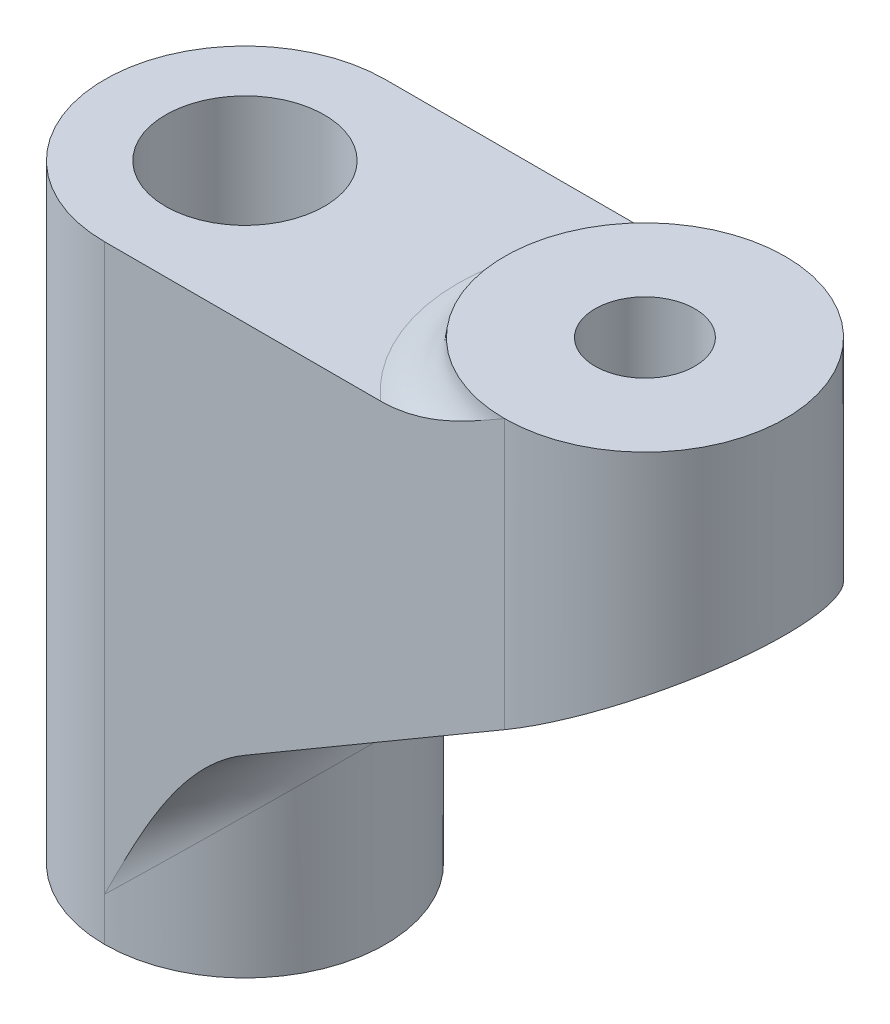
ISO-10303-21;
HEADER;
FILE_DESCRIPTION(('STEP AP214'),'2;1');
FILE_NAME('part.step','',(''),(''),'','','');
FILE_SCHEMA(('AUTOMOTIVE_DESIGN { 1 0 10303 214 1 1 1 1 }'));
ENDSEC;
DATA;
#1=APPLICATION_CONTEXT('core data for automotive mechanical design processes');
#2=APPLICATION_PROTOCOL_DEFINITION('international standard','automotive_design',2000,#1);
#3=PRODUCT_CONTEXT('',#1,'mechanical');
#4=PRODUCT('Part','Part','',(#3));
#5=PRODUCT_RELATED_PRODUCT_CATEGORY('part','',(#4));
#6=PRODUCT_DEFINITION_FORMATION('','',#4);
#7=PRODUCT_DEFINITION_CONTEXT('part definition',#1,'design');
#8=PRODUCT_DEFINITION('design','',#6,#7);
#9=PRODUCT_DEFINITION_SHAPE('','',#8);
#10=(LENGTH_UNIT() NAMED_UNIT(*) SI_UNIT(.MILLI.,.METRE.));
#11=(NAMED_UNIT(*) PLANE_ANGLE_UNIT() SI_UNIT($,.RADIAN.));
#12=(NAMED_UNIT(*) SI_UNIT($,.STERADIAN.) SOLID_ANGLE_UNIT());
#13=UNCERTAINTY_MEASURE_WITH_UNIT(LENGTH_MEASURE(1.E-05),#10,'distance_accuracy_value','');
#14=(GEOMETRIC_REPRESENTATION_CONTEXT(3) GLOBAL_UNCERTAINTY_ASSIGNED_CONTEXT((#13)) GLOBAL_UNIT_ASSIGNED_CONTEXT((#10,
#11,#12)) REPRESENTATION_CONTEXT('',''));
#15=CARTESIAN_POINT('',(0.,0.,0.));
#16=DIRECTION('',(0.,0.,1.));
#17=DIRECTION('',(1.,0.,0.));
#18=AXIS2_PLACEMENT_3D('',#15,#16,#17);
#19=CARTESIAN_POINT('',(0.,12.7,0.));
#20=DIRECTION('',(0.,1.,0.));
#21=DIRECTION('',(-1.,0.,0.));
#22=AXIS2_PLACEMENT_3D('',#19,#20,#21);
#23=CYLINDRICAL_SURFACE('',#22,3.81);
#24=DIRECTION('',(0.,-1.,0.));
#25=VECTOR('',#24,1.);
#26=CARTESIAN_POINT('',(0.,0.,-3.81));
#27=LINE('',#26,#25);
#28=CARTESIAN_POINT('',(0.,0.,-3.81));
#29=VERTEX_POINT('',#28);
#30=CARTESIAN_POINT('',(0.,1.17739829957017,-3.81));
#31=VERTEX_POINT('',#30);
#32=EDGE_CURVE('E166',#29,#31,#27,.F.);
#33=ORIENTED_EDGE('',*,*,#32,.T.);
#34=CARTESIAN_POINT('',(0.,1.17739829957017,0.));
#35=DIRECTION('',(0.698226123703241,-0.715877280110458,0.));
#36=DIRECTION('',(0.715877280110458,0.698226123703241,0.));
#37=AXIS2_PLACEMENT_3D('',#34,#35,#36);
#38=ELLIPSE('',#37,5.32214124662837,3.81);
#39=CARTESIAN_POINT('',(0.,1.17739829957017,3.81));
#40=VERTEX_POINT('',#39);
#41=EDGE_CURVE('E189',#31,#40,#38,.T.);
#42=ORIENTED_EDGE('',*,*,#41,.T.);
#43=DIRECTION('',(0.,1.,0.));
#44=VECTOR('',#43,1.);
#45=CARTESIAN_POINT('',(0.,0.,3.81));
#46=LINE('',#45,#44);
#47=CARTESIAN_POINT('',(0.,0.,3.81));
#48=VERTEX_POINT('',#47);
#49=EDGE_CURVE('E170',#40,#48,#46,.F.);
#50=ORIENTED_EDGE('',*,*,#49,.T.);
#51=CARTESIAN_POINT('',(0.,0.,0.));
#52=DIRECTION('',(0.,1.,0.));
#53=DIRECTION('',(0.,0.,1.));
#54=AXIS2_PLACEMENT_3D('',#51,#52,#53);
#55=CIRCLE('',#54,3.81);
#56=EDGE_CURVE('E182',#29,#48,#55,.F.);
#57=ORIENTED_EDGE('',*,*,#56,.F.);
#58=EDGE_LOOP('',(#33,#42,#50,#57));
#59=FACE_BOUND('',#58,.T.);
#60=ADVANCED_FACE('F54',(#59),#23,.T.);
#61=CARTESIAN_POINT('',(0.,0.,0.));
#62=DIRECTION('',(0.,-1.,0.));
#63=DIRECTION('',(1.,0.,0.));
#64=AXIS2_PLACEMENT_3D('',#61,#62,#63);
#65=CYLINDRICAL_SURFACE('',#64,3.81);
#66=ORIENTED_EDGE('',*,*,#32,.F.);
#67=CARTESIAN_POINT('',(0.,0.,0.));
#68=DIRECTION('',(0.,1.,0.));
#69=DIRECTION('',(0.,0.,1.));
#70=AXIS2_PLACEMENT_3D('',#67,#68,#69);
#71=CIRCLE('',#70,3.81);
#72=EDGE_CURVE('E174',#48,#29,#71,.F.);
#73=ORIENTED_EDGE('',*,*,#72,.F.);
#74=ORIENTED_EDGE('',*,*,#49,.F.);
#75=CARTESIAN_POINT('',(0.,16.51,3.81));
#76=VERTEX_POINT('',#75);
#77=EDGE_CURVE('E171',#76,#40,#46,.F.);
#78=ORIENTED_EDGE('',*,*,#77,.F.);
#79=CARTESIAN_POINT('',(0.,16.51,0.));
#80=DIRECTION('',(0.,-1.,0.));
#81=DIRECTION('',(1.,0.,0.));
#82=AXIS2_PLACEMENT_3D('',#79,#80,#81);
#83=CIRCLE('',#82,3.81);
#84=CARTESIAN_POINT('',(0.,16.51,-3.81));
#85=VERTEX_POINT('',#84);
#86=EDGE_CURVE('E178',#85,#76,#83,.F.);
#87=ORIENTED_EDGE('',*,*,#86,.F.);
#88=EDGE_CURVE('E149',#31,#85,#27,.F.);
#89=ORIENTED_EDGE('',*,*,#88,.F.);
#90=EDGE_LOOP('',(#66,#73,#74,#78,#87,#89));
#91=FACE_BOUND('',#90,.T.);
#92=ADVANCED_FACE('F251',(#91),#65,.T.);
#93=CARTESIAN_POINT('',(10.85088,10.4703651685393,0.));
#94=DIRECTION('',(0.,1.,0.));
#95=DIRECTION('',(-1.,0.,0.));
#96=AXIS2_PLACEMENT_3D('',#93,#94,#95);
#97=CYLINDRICAL_SURFACE('',#96,3.81);
#98=CARTESIAN_POINT('',(10.85088,17.78,0.));
#99=DIRECTION('',(0.,1.,0.));
#100=DIRECTION('',(-1.,0.,0.));
#101=AXIS2_PLACEMENT_3D('',#98,#99,#100);
#102=CIRCLE('',#101,3.81);
#103=CARTESIAN_POINT('',(10.85088,17.78,3.81));
#104=VERTEX_POINT('',#103);
#105=CARTESIAN_POINT('',(10.85088,17.78,-3.81));
#106=VERTEX_POINT('',#105);
#107=EDGE_CURVE('E155',#104,#106,#102,.T.);
#108=ORIENTED_EDGE('',*,*,#107,.F.);
#109=DIRECTION('',(0.,-1.,0.));
#110=VECTOR('',#109,1.);
#111=CARTESIAN_POINT('',(10.85088,10.4703651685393,3.81));
#112=LINE('',#111,#110);
#113=CARTESIAN_POINT('',(10.85088,10.4703651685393,3.81));
#114=VERTEX_POINT('',#113);
#115=EDGE_CURVE('E131',#114,#104,#112,.F.);
#116=ORIENTED_EDGE('',*,*,#115,.F.);
#117=CARTESIAN_POINT('',(10.85088,10.4703651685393,0.));
#118=DIRECTION('',(-0.505076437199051,0.863074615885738,0.));
#119=DIRECTION('',(0.863074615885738,0.505076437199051,0.));
#120=AXIS2_PLACEMENT_3D('',#117,#118,#119);
#121=ELLIPSE('',#120,4.41445030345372,3.81);
#122=CARTESIAN_POINT('',(10.85088,10.4703651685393,-3.81));
#123=VERTEX_POINT('',#122);
#124=EDGE_CURVE('E142',#123,#114,#121,.F.);
#125=ORIENTED_EDGE('',*,*,#124,.F.);
#126=DIRECTION('',(0.,1.,0.));
#127=VECTOR('',#126,1.);
#128=CARTESIAN_POINT('',(10.85088,0.,-3.81));
#129=LINE('',#128,#127);
#130=EDGE_CURVE('E150',#106,#123,#129,.F.);
#131=ORIENTED_EDGE('',*,*,#130,.F.);
#132=EDGE_LOOP('',(#108,#116,#125,#131));
#133=FACE_BOUND('',#132,.T.);
#134=ADVANCED_FACE('F153',(#133),#97,.T.);
#135=CARTESIAN_POINT('',(-3.81,0.,3.81));
#136=DIRECTION('',(0.,1.,0.));
#137=DIRECTION('',(0.,0.,1.));
#138=AXIS2_PLACEMENT_3D('',#135,#136,#137);
#139=PLANE('',#138);
#140=CARTESIAN_POINT('',(0.,0.,0.));
#141=DIRECTION('',(0.,1.,0.));
#142=DIRECTION('',(0.,0.,1.));
#143=AXIS2_PLACEMENT_3D('',#140,#141,#142);
#144=CIRCLE('',#143,2.15265);
#145=CARTESIAN_POINT('',(0.,0.,2.15265));
#146=VERTEX_POINT('',#145);
#147=EDGE_CURVE('E271',#146,#146,#144,.T.);
#148=ORIENTED_EDGE('',*,*,#147,.T.);
#149=EDGE_LOOP('',(#148));
#150=FACE_BOUND('',#149,.T.);
#151=ORIENTED_EDGE('',*,*,#72,.T.);
#152=ORIENTED_EDGE('',*,*,#56,.T.);
#153=EDGE_LOOP('',(#151,#152));
#154=FACE_BOUND('',#153,.T.);
#155=ADVANCED_FACE('F292',(#150,#154),#139,.F.);
#156=CARTESIAN_POINT('',(3.81,6.35,3.81));
#157=DIRECTION('',(-0.505076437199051,0.863074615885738,0.));
#158=DIRECTION('',(-0.863074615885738,-0.505076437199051,0.));
#159=AXIS2_PLACEMENT_3D('',#156,#157,#158);
#160=PLANE('',#159);
#161=CARTESIAN_POINT('',(10.85088,10.4703651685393,0.));
#162=DIRECTION('',(-0.505076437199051,0.863074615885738,0.));
#163=DIRECTION('',(0.863074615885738,0.505076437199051,0.));
#164=AXIS2_PLACEMENT_3D('',#161,#162,#163);
#165=ELLIPSE('',#164,1.56712985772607,1.35255);
#166=CARTESIAN_POINT('',(12.20343,11.2618855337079,0.));
#167=VERTEX_POINT('',#166);
#168=EDGE_CURVE('E59',#167,#167,#165,.T.);
#169=ORIENTED_EDGE('',*,*,#168,.T.);
#170=EDGE_LOOP('',(#169));
#171=FACE_BOUND('',#170,.T.);
#172=DIRECTION('',(0.863074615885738,0.505076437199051,0.));
#173=VECTOR('',#172,1.);
#174=CARTESIAN_POINT('',(3.81,6.35,3.81));
#175=LINE('',#174,#173);
#176=CARTESIAN_POINT('',(3.79710584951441,6.34245426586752,3.81));
#177=VERTEX_POINT('',#176);
#178=EDGE_CURVE('E127',#177,#114,#175,.T.);
#179=ORIENTED_EDGE('',*,*,#178,.F.);
#180=CARTESIAN_POINT('',(-1.28289415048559,3.36960782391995,0.));
#181=DIRECTION('',(-0.505076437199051,0.863074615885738,0.));
#182=DIRECTION('',(0.863074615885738,0.505076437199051,0.));
#183=AXIS2_PLACEMENT_3D('',#180,#181,#182);
#184=ELLIPSE('',#183,7.35741717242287,6.35);
#185=CARTESIAN_POINT('',(3.79710584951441,6.34245426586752,-3.81));
#186=VERTEX_POINT('',#185);
#187=EDGE_CURVE('E186',#177,#186,#184,.T.);
#188=ORIENTED_EDGE('',*,*,#187,.T.);
#189=DIRECTION('',(0.863074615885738,0.505076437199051,0.));
#190=VECTOR('',#189,1.);
#191=CARTESIAN_POINT('',(3.81,6.35,-3.81));
#192=LINE('',#191,#190);
#193=EDGE_CURVE('E145',#186,#123,#192,.T.);
#194=ORIENTED_EDGE('',*,*,#193,.T.);
#195=ORIENTED_EDGE('',*,*,#124,.T.);
#196=EDGE_LOOP('',(#179,#188,#194,#195));
#197=FACE_BOUND('',#196,.T.);
#198=ADVANCED_FACE('F143',(#171,#197),#160,.F.);
#199=CARTESIAN_POINT('',(14.66088,16.51,3.81));
#200=DIRECTION('',(0.,-1.,0.));
#201=DIRECTION('',(1.,0.,0.));
#202=AXIS2_PLACEMENT_3D('',#199,#200,#201);
#203=PLANE('',#202);
#204=CARTESIAN_POINT('',(0.,16.51,0.));
#205=DIRECTION('',(0.,1.,0.));
#206=DIRECTION('',(0.,0.,1.));
#207=AXIS2_PLACEMENT_3D('',#204,#205,#206);
#208=CIRCLE('',#207,2.15265);
#209=CARTESIAN_POINT('',(0.,16.51,2.15265));
#210=VERTEX_POINT('',#209);
#211=EDGE_CURVE('E278',#210,#210,#208,.T.);
#212=ORIENTED_EDGE('',*,*,#211,.F.);
#213=EDGE_LOOP('',(#212));
#214=FACE_BOUND('',#213,.T.);
#215=DIRECTION('',(-1.,0.,0.));
#216=VECTOR('',#215,1.);
#217=CARTESIAN_POINT('',(14.66088,16.51,3.81));
#218=LINE('',#217,#216);
#219=CARTESIAN_POINT('',(7.49077583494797,16.51,3.81));
#220=VERTEX_POINT('',#219);
#221=EDGE_CURVE('E138',#220,#76,#218,.T.);
#222=ORIENTED_EDGE('',*,*,#221,.F.);
#223=CARTESIAN_POINT('',(10.85088,16.51,0.));
#224=DIRECTION('',(0.,-1.,0.));
#225=DIRECTION('',(1.,0.,0.));
#226=AXIS2_PLACEMENT_3D('',#223,#224,#225);
#227=CIRCLE('',#226,5.08);
#228=CARTESIAN_POINT('',(7.49077583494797,16.51,-3.81));
#229=VERTEX_POINT('',#228);
#230=EDGE_CURVE('E84',#220,#229,#227,.T.);
#231=ORIENTED_EDGE('',*,*,#230,.T.);
#232=DIRECTION('',(-1.,0.,0.));
#233=VECTOR('',#232,1.);
#234=CARTESIAN_POINT('',(14.66088,16.51,-3.81));
#235=LINE('',#234,#233);
#236=EDGE_CURVE('E139',#229,#85,#235,.T.);
#237=ORIENTED_EDGE('',*,*,#236,.T.);
#238=ORIENTED_EDGE('',*,*,#86,.T.);
#239=EDGE_LOOP('',(#222,#231,#237,#238));
#240=FACE_BOUND('',#239,.T.);
#241=ADVANCED_FACE('F234',(#214,#240),#203,.F.);
#242=CARTESIAN_POINT('',(0.,0.,3.81));
#243=DIRECTION('',(0.,0.,1.));
#244=DIRECTION('',(1.,0.,0.));
#245=AXIS2_PLACEMENT_3D('',#242,#243,#244);
#246=PLANE('',#245);
#247=ORIENTED_EDGE('',*,*,#77,.T.);
#248=CARTESIAN_POINT('',(5.06710584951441,7.08566587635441,0.));
#249=CARTESIAN_POINT('',(4.48315279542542,6.74393304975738,0.));
#250=CARTESIAN_POINT('',(4.14657639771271,6.15699282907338,0.));
#251=CARTESIAN_POINT('',(3.81,5.57005260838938,0.));
#252=CARTESIAN_POINT('',(3.81,4.89345635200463,0.));
#253=CARTESIAN_POINT('',(5.06710584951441,7.08566587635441,-0.277338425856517));
#254=CARTESIAN_POINT('',(4.48315279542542,6.74393304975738,-0.243099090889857));
#255=CARTESIAN_POINT('',(4.14657639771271,6.15699282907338,-0.21339764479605));
#256=CARTESIAN_POINT('',(3.81,5.57005260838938,-0.183695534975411));
#257=CARTESIAN_POINT('',(3.81,4.89345635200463,-0.16640305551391));
#258=CARTESIAN_POINT('',(5.04887412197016,7.07499656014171,-0.554676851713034));
#259=CARTESIAN_POINT('',(4.46617554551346,6.73399786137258,-0.486252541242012));
#260=CARTESIAN_POINT('',(4.13148274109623,6.14693090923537,-0.426795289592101));
#261=CARTESIAN_POINT('',(3.79677645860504,5.55985497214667,-0.367432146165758));
#262=CARTESIAN_POINT('',(3.79906096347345,4.88278703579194,-0.33280611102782));
#263=CARTESIAN_POINT('',(4.97647943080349,7.03263075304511,-1.10458488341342));
#264=CARTESIAN_POINT('',(4.3988229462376,6.69458271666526,-0.967840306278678));
#265=CARTESIAN_POINT('',(4.07159363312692,6.1069926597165,-0.849371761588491));
#266=CARTESIAN_POINT('',(3.74435113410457,5.5193938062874,-0.730997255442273));
#267=CARTESIAN_POINT('',(3.75562414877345,4.84042122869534,-0.66275093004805));
#268=CARTESIAN_POINT('',(4.92211012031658,7.00081350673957,-1.3771178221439));
#269=CARTESIAN_POINT('',(4.34822588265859,6.66497301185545,-1.20634338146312));
#270=CARTESIAN_POINT('',(4.02662761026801,6.07700253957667,-1.05851921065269));
#271=CARTESIAN_POINT('',(3.70497688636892,5.48899706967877,-0.91087551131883));
#272=CARTESIAN_POINT('',(3.7230025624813,4.8086039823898,-0.826270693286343));
#273=CARTESIAN_POINT('',(4.77857649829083,6.91681677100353,-1.9128066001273));
#274=CARTESIAN_POINT('',(4.2148102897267,6.58689740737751,-1.67419288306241));
#275=CARTESIAN_POINT('',(3.9080669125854,5.99788147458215,-1.46853001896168));
#276=CARTESIAN_POINT('',(3.60127066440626,5.40883025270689,-1.26305092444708));
#277=CARTESIAN_POINT('',(3.63688238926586,4.72460724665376,-1.14768396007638));
#278=CARTESIAN_POINT('',(4.68903698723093,6.86441771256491,-2.17582675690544));
#279=CARTESIAN_POINT('',(4.1315871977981,6.53819475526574,-1.90349936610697));
#280=CARTESIAN_POINT('',(3.83416355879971,5.94854414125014,-1.66927731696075));
#281=CARTESIAN_POINT('',(3.53662527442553,5.35881693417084,-1.43530979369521));
#282=CARTESIAN_POINT('',(3.58315868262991,4.67220818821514,-1.30549605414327));
#283=CARTESIAN_POINT('',(4.47684961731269,6.74024439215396,-2.6881039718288));
#284=CARTESIAN_POINT('',(3.93466145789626,6.42295263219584,-2.34875875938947));
#285=CARTESIAN_POINT('',(3.65933982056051,5.83173567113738,-2.05864509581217));
#286=CARTESIAN_POINT('',(3.3839008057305,5.24044027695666,-1.76879368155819));
#287=CARTESIAN_POINT('',(3.45584626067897,4.54803486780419,-1.61286238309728));
#288=CARTESIAN_POINT('',(4.35372074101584,6.6681886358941,-2.9370921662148));
#289=CARTESIAN_POINT('',(3.82043695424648,6.35610776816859,-2.56452304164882));
#290=CARTESIAN_POINT('',(3.55802710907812,5.76400114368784,-2.24703579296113));
#291=CARTESIAN_POINT('',(3.29542040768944,5.17176277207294,-1.92986024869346));
#292=CARTESIAN_POINT('',(3.38196893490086,4.47597911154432,-1.76225529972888));
#293=CARTESIAN_POINT('',(4.07654409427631,6.50598320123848,-3.41718519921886));
#294=CARTESIAN_POINT('',(3.5637666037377,6.20590274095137,-2.97879161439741));
#295=CARTESIAN_POINT('',(3.33048899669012,5.61171109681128,-2.60812362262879));
#296=CARTESIAN_POINT('',(3.09700791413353,5.01738325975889,-2.23777923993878));
#297=CARTESIAN_POINT('',(3.21566294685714,4.3137736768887,-2.05031111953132));
#298=CARTESIAN_POINT('',(3.92198023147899,6.41553150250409,-3.64788802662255));
#299=CARTESIAN_POINT('',(3.42075561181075,6.12221185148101,-3.17695380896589));
#300=CARTESIAN_POINT('',(3.2038484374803,5.52687504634,-2.78047770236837));
#301=CARTESIAN_POINT('',(2.98664621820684,4.93134033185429,-2.38434973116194));
#302=CARTESIAN_POINT('',(3.12292462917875,4.22332197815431,-2.18873281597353));
#303=CARTESIAN_POINT('',(3.58458788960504,6.21808748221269,-4.08759290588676));
#304=CARTESIAN_POINT('',(3.10924728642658,5.93991531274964,-3.55244658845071));
#305=CARTESIAN_POINT('',(2.92821236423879,5.34197796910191,-3.10624965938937));
#306=CARTESIAN_POINT('',(2.74687092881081,4.74383500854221,-2.66041558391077));
#307=CARTESIAN_POINT('',(2.92048922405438,4.02587795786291,-2.45255574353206));
#308=CARTESIAN_POINT('',(3.40127063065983,6.11080912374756,-4.29608903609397));
#309=CARTESIAN_POINT('',(2.9402073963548,5.84099215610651,-3.72930734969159));
#310=CARTESIAN_POINT('',(2.77883190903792,5.24165424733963,-3.25923689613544));
#311=CARTESIAN_POINT('',(2.61705204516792,4.64204432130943,-2.78952716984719));
#312=CARTESIAN_POINT('',(2.81049886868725,3.91859959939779,-2.57765342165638));
#313=CARTESIAN_POINT('',(3.00945841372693,5.88151826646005,-4.68790590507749));
#314=CARTESIAN_POINT('',(2.57981881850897,5.6300906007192,-4.05900864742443));
#315=CARTESIAN_POINT('',(2.46069066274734,5.0276411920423,-3.54340745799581));
#316=CARTESIAN_POINT('',(2.34114183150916,4.42490878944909,-3.02818250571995));
#317=CARTESIAN_POINT('',(2.57541153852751,3.68930874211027,-2.81274354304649));
#318=CARTESIAN_POINT('',(2.80054638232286,5.75926169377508,-4.87066414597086));
#319=CARTESIAN_POINT('',(2.38799778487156,5.51783578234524,-4.21129688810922));
#320=CARTESIAN_POINT('',(2.29161190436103,4.91373157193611,-3.67411385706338));
#321=CARTESIAN_POINT('',(2.1947067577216,4.30927685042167,-3.13727815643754));
#322=CARTESIAN_POINT('',(2.45006431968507,3.56705216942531,-2.92239848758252));
#323=CARTESIAN_POINT('',(2.36103092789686,5.50205461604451,-5.20791936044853));
#324=CARTESIAN_POINT('',(1.98563062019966,5.28236810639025,-4.48910311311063));
#325=CARTESIAN_POINT('',(1.93742546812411,4.67464818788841,-3.91128622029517));
#326=CARTESIAN_POINT('',(1.88868100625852,4.06656421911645,-3.33383085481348));
#327=CARTESIAN_POINT('',(2.18635504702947,3.30984509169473,-3.12475161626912));
#328=CARTESIAN_POINT('',(2.13010578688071,5.36691583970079,-5.36185096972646));
#329=CARTESIAN_POINT('',(1.77470861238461,5.15893528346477,-4.61403920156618));
#330=CARTESIAN_POINT('',(1.75208478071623,4.54930910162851,-4.01727562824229));
#331=CARTESIAN_POINT('',(1.72882746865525,3.939253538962,-3.4208190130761));
#332=CARTESIAN_POINT('',(2.04779996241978,3.17470631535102,-3.21711058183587));
#333=CARTESIAN_POINT('',(1.65040977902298,5.08619486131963,-5.63880563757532));
#334=CARTESIAN_POINT('',(1.33808429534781,4.90342011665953,-4.83489093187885));
#335=CARTESIAN_POINT('',(1.36905341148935,4.28968411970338,-4.20306864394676));
#336=CARTESIAN_POINT('',(1.39936725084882,3.67550396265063,-3.5715645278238));
#337=CARTESIAN_POINT('',(1.75998235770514,2.89398533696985,-3.38328338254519));
#338=CARTESIAN_POINT('',(1.40141746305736,4.94048306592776,-5.76131156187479));
#339=CARTESIAN_POINT('',(1.11210933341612,4.77117821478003,-4.93024618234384));
#340=CARTESIAN_POINT('',(1.17121563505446,4.15528950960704,-4.28244002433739));
#341=CARTESIAN_POINT('',(1.2295816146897,3.53889654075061,-3.63487389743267));
#342=CARTESIAN_POINT('',(1.61058696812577,2.74827354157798,-3.45678693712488));
#343=CARTESIAN_POINT('',(0.889742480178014,4.64104779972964,-5.97325555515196));
#344=CARTESIAN_POINT('',(0.649627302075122,4.50053095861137,-5.09024858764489));
#345=CARTESIAN_POINT('',(0.767134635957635,3.88005331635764,-4.41360256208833));
#346=CARTESIAN_POINT('',(0.883880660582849,3.25905711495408,-3.73720393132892));
#347=CARTESIAN_POINT('',(1.30358197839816,2.44883827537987,-3.58395333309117));
#348=CARTESIAN_POINT('',(0.62692897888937,4.48724776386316,-6.0622678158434));
#349=CARTESIAN_POINT('',(0.412942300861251,4.36202147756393,-5.15440031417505));
#350=CARTESIAN_POINT('',(0.560817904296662,3.73915272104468,-4.46504203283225));
#351=CARTESIAN_POINT('',(0.707860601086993,3.1157133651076,-3.77583235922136));
#352=CARTESIAN_POINT('',(1.14589387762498,2.29503823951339,-3.63736068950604));
#353=CARTESIAN_POINT('',(0.0920172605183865,4.17421422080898,-6.20559771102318));
#354=CARTESIAN_POINT('',(-0.0664802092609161,4.08146055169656,-5.25093007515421));
#355=CARTESIAN_POINT('',(0.143913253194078,3.45354555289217,-4.53955261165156));
#356=CARTESIAN_POINT('',(0.353456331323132,2.82504798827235,-3.82832738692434));
#357=CARTESIAN_POINT('',(0.824946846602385,1.9820046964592,-3.7233586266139));
#358=CARTESIAN_POINT('',(-0.180140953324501,4.01494560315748,-6.259613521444));
#359=CARTESIAN_POINT('',(-0.309319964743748,3.9393492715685,-5.2829105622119));
#360=CARTESIAN_POINT('',(-0.0666960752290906,3.3088167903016,-4.56237847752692));
#361=CARTESIAN_POINT('',(0.175023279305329,2.67766046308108,-3.84188295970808));
#362=CARTESIAN_POINT('',(0.661651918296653,1.8227360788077,-3.7557681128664));
#363=CARTESIAN_POINT('',(-0.729153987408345,3.69365988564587,-6.33189279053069));
#364=CARTESIAN_POINT('',(-0.796427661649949,3.65429092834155,-5.31470646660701));
#365=CARTESIAN_POINT('',(-0.48795228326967,3.01828593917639,-4.57952696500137));
#366=CARTESIAN_POINT('',(-0.180393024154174,2.38164913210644,-3.84438501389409));
#367=CARTESIAN_POINT('',(0.332244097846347,1.50145036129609,-3.79913567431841));
#368=CARTESIAN_POINT('',(-1.00602406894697,3.53163385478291,-6.35));
#369=CARTESIAN_POINT('',(-1.04074748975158,3.51131350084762,-5.31424365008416));
#370=CARTESIAN_POINT('',(-0.698595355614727,2.8724819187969,-4.5737253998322));
#371=CARTESIAN_POINT('',(-0.357392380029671,2.23299057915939,-3.83311685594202));
#372=CARTESIAN_POINT('',(0.166122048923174,1.33942433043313,-3.81));
#373=CARTESIAN_POINT('',(-1.55976423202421,3.20758179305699,-6.35));
#374=CARTESIAN_POINT('',(-1.526147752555,3.22725435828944,-5.28147672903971));
#375=CARTESIAN_POINT('',(-1.1156909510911,2.58256712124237,-4.53417215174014));
#376=CARTESIAN_POINT('',(-0.706187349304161,1.9372173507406,-3.78677746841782));
#377=CARTESIAN_POINT('',(-0.166122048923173,1.01537226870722,-3.81));
#378=CARTESIAN_POINT('',(-1.83663431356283,3.04555576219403,-6.33189279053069));
#379=CARTESIAN_POINT('',(-1.76725781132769,3.08615530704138,-5.24902372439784));
#380=CARTESIAN_POINT('',(-1.32214347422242,2.43845634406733,-4.50042046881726));
#381=CARTESIAN_POINT('',(-0.877991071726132,1.79008265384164,-3.75159292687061));
#382=CARTESIAN_POINT('',(-0.332244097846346,0.853346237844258,-3.79913567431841));
#383=CARTESIAN_POINT('',(-2.38564734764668,2.72427004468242,-6.259613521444));
#384=CARTESIAN_POINT('',(-2.24164419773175,2.80854155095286,-5.15334063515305));
#385=CARTESIAN_POINT('',(-1.72675517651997,2.15466228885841,-4.40622598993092));
#386=CARTESIAN_POINT('',(-1.21282399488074,1.5001112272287,-3.65888870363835));
#387=CARTESIAN_POINT('',(-0.661651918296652,0.532060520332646,-3.7557681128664));
#388=CARTESIAN_POINT('',(-2.65780556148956,2.56500142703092,-6.20559771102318));
#389=CARTESIAN_POINT('',(-2.47495579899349,2.67200620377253,-5.09009008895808));
#390=CARTESIAN_POINT('',(-1.92494635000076,2.01496256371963,-4.34589921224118));
#391=CARTESIAN_POINT('',(-1.37587675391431,1.3572527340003,-3.6013522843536));
#392=CARTESIAN_POINT('',(-0.824946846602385,0.372791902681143,-3.7233586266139));
#393=CARTESIAN_POINT('',(-3.19271727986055,2.25196788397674,-6.0622678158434));
#394=CARTESIAN_POINT('',(-2.92935596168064,2.40608850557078,-4.93461995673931));
#395=CARTESIAN_POINT('',(-2.3091925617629,1.74261746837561,-4.20051380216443));
#396=CARTESIAN_POINT('',(-1.68995741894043,1.07848854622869,-3.46605686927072));
#397=CARTESIAN_POINT('',(-1.14589387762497,0.0597583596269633,-3.63736068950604));
#398=CARTESIAN_POINT('',(-3.45553078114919,2.09816784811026,-5.97325555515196));
#399=CARTESIAN_POINT('',(-3.15051045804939,2.2766675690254,-4.84249724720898));
#400=CARTESIAN_POINT('',(-2.49533592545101,1.60992250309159,-4.11566824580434));
#401=CARTESIAN_POINT('',(-1.84104378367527,0.94254436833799,-3.38836421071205));
#402=CARTESIAN_POINT('',(-1.30358197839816,-0.0940416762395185,-3.58395333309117));
#403=CARTESIAN_POINT('',(-3.96720576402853,1.79873258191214,-5.76131156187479));
#404=CARTESIAN_POINT('',(-3.57655845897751,2.02734172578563,-4.63180705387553));
#405=CARTESIAN_POINT('',(-2.85205205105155,1.35402252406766,-3.92386591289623));
#406=CARTESIAN_POINT('',(-2.12841076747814,0.680082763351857,-3.21546018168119));
#407=CARTESIAN_POINT('',(-1.61058696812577,-0.393476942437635,-3.45678693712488));
#408=CARTESIAN_POINT('',(-4.21619807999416,1.65302078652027,-5.63880563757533));
#409=CARTESIAN_POINT('',(-3.78156791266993,1.90736896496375,-4.51343354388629));
#410=CARTESIAN_POINT('',(-3.02278668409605,1.23072170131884,-3.81719067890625));
#411=CARTESIAN_POINT('',(-2.26479756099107,0.553498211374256,-3.12037751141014));
#412=CARTESIAN_POINT('',(-1.75998235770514,-0.539188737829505,-3.38328338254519));
#413=CARTESIAN_POINT('',(-4.69589408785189,1.37229980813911,-5.36185096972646));
#414=CARTESIAN_POINT('',(-4.1717962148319,1.67900502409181,-4.25341073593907));
#415=CARTESIAN_POINT('',(-3.3458161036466,0.995763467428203,-3.58492530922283));
#416=CARTESIAN_POINT('',(-2.52060790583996,0.311960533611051,-2.91588561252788));
#417=CARTESIAN_POINT('',(-2.04779996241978,-0.819909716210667,-3.21711058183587));
#418=CARTESIAN_POINT('',(-4.92681922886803,1.23716103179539,-5.20791936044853));
#419=CARTESIAN_POINT('',(-4.35719184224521,1.57051039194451,-4.11202497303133));
#420=CARTESIAN_POINT('',(-3.49835295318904,0.883956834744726,-3.45964937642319));
#421=CARTESIAN_POINT('',(-2.64018906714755,0.196904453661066,-2.80664203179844));
#422=CARTESIAN_POINT('',(-2.18635504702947,-0.955048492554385,-3.12475161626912));
#423=CARTESIAN_POINT('',(-5.36633468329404,0.979953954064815,-4.87066414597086));
#424=CARTESIAN_POINT('',(-4.70532832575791,1.36677883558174,-3.80966012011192));
#425=CARTESIAN_POINT('',(-3.78283571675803,0.673765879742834,-3.19380577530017));
#426=CARTESIAN_POINT('',(-2.86099812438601,-0.019730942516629,-2.57734028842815));
#427=CARTESIAN_POINT('',(-2.45006431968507,-1.21225557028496,-2.92239848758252));
#428=CARTESIAN_POINT('',(-5.57524671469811,0.857697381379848,-4.68790590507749));
#429=CARTESIAN_POINT('',(-4.86830639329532,1.27140309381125,-3.64898246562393));
#430=CARTESIAN_POINT('',(-3.91509694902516,0.575179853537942,-3.05354626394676));
#431=CARTESIAN_POINT('',(-2.96242796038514,-0.121449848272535,-2.45745846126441));
#432=CARTESIAN_POINT('',(-2.57541153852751,-1.33451214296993,-2.81274354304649));
#433=CARTESIAN_POINT('',(-5.96705893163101,0.628406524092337,-4.29608903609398));
#434=CARTESIAN_POINT('',(-5.16954467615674,1.09511664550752,-3.31202422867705));
#435=CARTESIAN_POINT('',(-4.15771991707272,0.392752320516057,-2.7615592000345));
#436=CARTESIAN_POINT('',(-3.14641864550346,-0.310005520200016,-2.21046534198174));
#437=CARTESIAN_POINT('',(-2.81049886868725,-1.56380300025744,-2.57765342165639));
#438=CARTESIAN_POINT('',(-6.15037619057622,0.52112816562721,-4.08759290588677));
#439=CARTESIAN_POINT('',(-5.30808932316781,1.01403948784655,-3.1360519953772));
#440=CARTESIAN_POINT('',(-4.26844837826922,0.308667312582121,-2.61009856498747));
#441=CARTESIAN_POINT('',(-3.22920785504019,-0.397011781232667,-2.08351912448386));
#442=CARTESIAN_POINT('',(-2.92048922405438,-1.67108135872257,-2.45255574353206));
#443=CARTESIAN_POINT('',(-6.48776853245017,0.32368414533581,-3.64788802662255));
#444=CARTESIAN_POINT('',(-5.55927716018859,0.867042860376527,-2.77251988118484));
#445=CARTESIAN_POINT('',(-4.4675960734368,0.156055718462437,-2.29942813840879));
#446=CARTESIAN_POINT('',(-3.37630325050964,-0.555228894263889,-1.82573203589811));
#447=CARTESIAN_POINT('',(-3.12292462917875,-1.86852537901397,-2.18873281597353));
#448=CARTESIAN_POINT('',(-6.64233239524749,0.233232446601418,-3.41718519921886));
#449=CARTESIAN_POINT('',(-5.67222675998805,0.800944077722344,-2.58525084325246));
#450=CARTESIAN_POINT('',(-4.55639868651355,0.0872642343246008,-2.14041986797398));
#451=CARTESIAN_POINT('',(-3.44083847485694,-0.626624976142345,-1.6950327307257));
#452=CARTESIAN_POINT('',(-3.21566294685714,-1.95897707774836,-2.05031111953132));
#453=CARTESIAN_POINT('',(-6.91950904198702,0.0710270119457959,-2.9370921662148));
#454=CARTESIAN_POINT('',(-5.87189496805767,0.684097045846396,-2.20282890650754));
#455=CARTESIAN_POINT('',(-4.71212209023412,-0.0344489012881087,-1.81791216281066));
#456=CARTESIAN_POINT('',(-3.5526100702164,-0.753198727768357,-1.43245656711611));
#457=CARTESIAN_POINT('',(-3.38196893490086,-2.12118251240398,-1.76225529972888));
#458=CARTESIAN_POINT('',(-7.04263791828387,-0.00102874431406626,-2.6881039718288));
#459=CARTESIAN_POINT('',(-5.95890894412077,0.633175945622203,-2.00793658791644));
#460=CARTESIAN_POINT('',(-4.77940164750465,-0.0876293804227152,-1.65454164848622));
#461=CARTESIAN_POINT('',(-3.60004896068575,-0.80855780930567,-1.30069841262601));
#462=CARTESIAN_POINT('',(-3.45584626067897,-2.19323826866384,-1.61286238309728));
#463=CARTESIAN_POINT('',(-7.2548252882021,-0.125202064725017,-2.17582675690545));
#464=CARTESIAN_POINT('',(-6.10706085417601,0.546476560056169,-1.61333805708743));
#465=CARTESIAN_POINT('',(-4.893122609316,-0.178224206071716,-1.32577386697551));
#466=CARTESIAN_POINT('',(-3.67933610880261,-0.903045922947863,-1.03777228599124));
#467=CARTESIAN_POINT('',(-3.58315868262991,-2.31741158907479,-1.30549605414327));
#468=CARTESIAN_POINT('',(-7.34436479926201,-0.177601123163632,-1.9128066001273));
#469=CARTESIAN_POINT('',(-6.16844961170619,0.510551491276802,-1.41386249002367));
#470=CARTESIAN_POINT('',(-4.93986000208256,-0.215861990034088,-1.16044322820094));
#471=CARTESIAN_POINT('',(-3.71133983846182,-0.942331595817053,-0.906711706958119));
#472=CARTESIAN_POINT('',(-3.63688238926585,-2.36981064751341,-1.14768396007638));
#473=CARTESIAN_POINT('',(-7.48789842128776,-0.261597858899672,-1.37711782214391));
#474=CARTESIAN_POINT('',(-6.26607483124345,0.45342062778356,-1.01233403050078));
#475=CARTESIAN_POINT('',(-5.01377925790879,-0.275718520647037,-0.829233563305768));
#476=CARTESIAN_POINT('',(-3.76155264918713,-1.00491362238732,-0.645825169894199));
#477=CARTESIAN_POINT('',(-3.7230025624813,-2.45380738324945,-0.826270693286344));
#478=CARTESIAN_POINT('',(-7.54226773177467,-0.293415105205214,-1.10458488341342));
#479=CARTESIAN_POINT('',(-6.3024910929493,0.432109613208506,-0.810491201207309));
#480=CARTESIAN_POINT('',(-5.04116783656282,-0.298100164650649,-0.663379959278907));
#481=CARTESIAN_POINT('',(-3.77986189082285,-1.02832403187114,-0.516109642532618));
#482=CARTESIAN_POINT('',(-3.75562414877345,-2.48562462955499,-0.662750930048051));
#483=CARTESIAN_POINT('',(-7.61466242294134,-0.335780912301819,-0.554676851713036));
#484=CARTESIAN_POINT('',(-6.35087066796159,0.403797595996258,-0.405664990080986));
#485=CARTESIAN_POINT('',(-5.07745748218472,-0.327816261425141,-0.331680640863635));
#486=CARTESIAN_POINT('',(-3.80406184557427,-1.05944457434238,-0.257536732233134));
#487=CARTESIAN_POINT('',(-3.79906096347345,-2.52799043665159,-0.332806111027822));
#488=CARTESIAN_POINT('',(-7.63289415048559,-0.34645022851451,-0.277338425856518));
#489=CARTESIAN_POINT('',(-6.36292704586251,0.396742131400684,-0.202881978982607));
#490=CARTESIAN_POINT('',(-5.08646352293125,-0.335236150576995,-0.165840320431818));
#491=CARTESIAN_POINT('',(-3.81,-1.06721443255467,-0.128799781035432));
#492=CARTESIAN_POINT('',(-3.81,-2.53865975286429,-0.166403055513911));
#493=CARTESIAN_POINT('',(-7.63289415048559,-0.34645022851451,0.277338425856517));
#494=CARTESIAN_POINT('',(-6.36292704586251,0.396742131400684,0.202881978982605));
#495=CARTESIAN_POINT('',(-5.08646352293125,-0.335236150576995,0.165840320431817));
#496=CARTESIAN_POINT('',(-3.81,-1.06721443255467,0.128799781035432));
#497=CARTESIAN_POINT('',(-3.81,-2.53865975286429,0.16640305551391));
#498=CARTESIAN_POINT('',(-7.61466242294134,-0.335780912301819,0.554676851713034));
#499=CARTESIAN_POINT('',(-6.35087066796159,0.403797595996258,0.405664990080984));
#500=CARTESIAN_POINT('',(-5.07745748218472,-0.327816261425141,0.331680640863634));
#501=CARTESIAN_POINT('',(-3.80406184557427,-1.05944457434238,0.257536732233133));
#502=CARTESIAN_POINT('',(-3.79906096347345,-2.52799043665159,0.332806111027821));
#503=CARTESIAN_POINT('',(-7.54226773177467,-0.293415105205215,1.10458488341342));
#504=CARTESIAN_POINT('',(-6.3024910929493,0.432109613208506,0.810491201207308));
#505=CARTESIAN_POINT('',(-5.04116783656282,-0.298100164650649,0.663379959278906));
#506=CARTESIAN_POINT('',(-3.77986189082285,-1.02832403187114,0.516109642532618));
#507=CARTESIAN_POINT('',(-3.75562414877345,-2.48562462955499,0.66275093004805));
#508=CARTESIAN_POINT('',(-7.48789842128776,-0.261597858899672,1.3771178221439));
#509=CARTESIAN_POINT('',(-6.26607483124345,0.45342062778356,1.01233403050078));
#510=CARTESIAN_POINT('',(-5.0137792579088,-0.275718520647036,0.829233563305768));
#511=CARTESIAN_POINT('',(-3.76155264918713,-1.00491362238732,0.645825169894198));
#512=CARTESIAN_POINT('',(-3.7230025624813,-2.45380738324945,0.826270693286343));
#513=CARTESIAN_POINT('',(-7.34436479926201,-0.177601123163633,1.9128066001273));
#514=CARTESIAN_POINT('',(-6.1684496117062,0.510551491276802,1.41386249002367));
#515=CARTESIAN_POINT('',(-4.93986000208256,-0.215861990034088,1.16044322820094));
#516=CARTESIAN_POINT('',(-3.71133983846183,-0.942331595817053,0.906711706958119));
#517=CARTESIAN_POINT('',(-3.63688238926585,-2.36981064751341,1.14768396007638));
#518=CARTESIAN_POINT('',(-7.2548252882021,-0.125202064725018,2.17582675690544));
#519=CARTESIAN_POINT('',(-6.10706085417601,0.546476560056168,1.61333805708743));
#520=CARTESIAN_POINT('',(-4.893122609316,-0.178224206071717,1.32577386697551));
#521=CARTESIAN_POINT('',(-3.67933610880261,-0.903045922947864,1.03777228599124));
#522=CARTESIAN_POINT('',(-3.58315868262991,-2.31741158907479,1.30549605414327));
#523=CARTESIAN_POINT('',(-7.04263791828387,-0.00102874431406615,2.6881039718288));
#524=CARTESIAN_POINT('',(-5.95890894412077,0.633175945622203,2.00793658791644));
#525=CARTESIAN_POINT('',(-4.77940164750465,-0.0876293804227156,1.65454164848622));
#526=CARTESIAN_POINT('',(-3.60004896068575,-0.80855780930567,1.300698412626));
#527=CARTESIAN_POINT('',(-3.45584626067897,-2.19323826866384,1.61286238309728));
#528=CARTESIAN_POINT('',(-6.91950904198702,0.0710270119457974,2.9370921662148));
#529=CARTESIAN_POINT('',(-5.87189496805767,0.684097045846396,2.20282890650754));
#530=CARTESIAN_POINT('',(-4.71212209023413,-0.0344489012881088,1.81791216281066));
#531=CARTESIAN_POINT('',(-3.5526100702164,-0.753198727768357,1.43245656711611));
#532=CARTESIAN_POINT('',(-3.38196893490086,-2.12118251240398,1.76225529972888));
#533=CARTESIAN_POINT('',(-6.64233239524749,0.233232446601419,3.41718519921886));
#534=CARTESIAN_POINT('',(-5.67222675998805,0.800944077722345,2.58525084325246));
#535=CARTESIAN_POINT('',(-4.55639868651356,0.0872642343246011,2.14041986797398));
#536=CARTESIAN_POINT('',(-3.44083847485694,-0.626624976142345,1.6950327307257));
#537=CARTESIAN_POINT('',(-3.21566294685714,-1.95897707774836,2.05031111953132));
#538=CARTESIAN_POINT('',(-6.48776853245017,0.32368414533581,3.64788802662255));
#539=CARTESIAN_POINT('',(-5.55927716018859,0.867042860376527,2.77251988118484));
#540=CARTESIAN_POINT('',(-4.4675960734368,0.156055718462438,2.29942813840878));
#541=CARTESIAN_POINT('',(-3.37630325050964,-0.555228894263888,1.82573203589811));
#542=CARTESIAN_POINT('',(-3.12292462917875,-1.86852537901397,2.18873281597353));
#543=CARTESIAN_POINT('',(-6.15037619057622,0.521128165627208,4.08759290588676));
#544=CARTESIAN_POINT('',(-5.30808932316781,1.01403948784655,3.1360519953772));
#545=CARTESIAN_POINT('',(-4.26844837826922,0.308667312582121,2.61009856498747));
#546=CARTESIAN_POINT('',(-3.22920785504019,-0.397011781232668,2.08351912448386));
#547=CARTESIAN_POINT('',(-2.92048922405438,-1.67108135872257,2.45255574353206));
#548=CARTESIAN_POINT('',(-5.96705893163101,0.628406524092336,4.29608903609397));
#549=CARTESIAN_POINT('',(-5.16954467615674,1.09511664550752,3.31202422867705));
#550=CARTESIAN_POINT('',(-4.15771991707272,0.392752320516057,2.76155920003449));
#551=CARTESIAN_POINT('',(-3.14641864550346,-0.310005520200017,2.21046534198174));
#552=CARTESIAN_POINT('',(-2.81049886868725,-1.56380300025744,2.57765342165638));
#553=CARTESIAN_POINT('',(-5.57524671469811,0.857697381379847,4.68790590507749));
#554=CARTESIAN_POINT('',(-4.86830639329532,1.27140309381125,3.64898246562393));
#555=CARTESIAN_POINT('',(-3.91509694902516,0.57517985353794,3.05354626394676));
#556=CARTESIAN_POINT('',(-2.96242796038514,-0.121449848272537,2.4574584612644));
#557=CARTESIAN_POINT('',(-2.57541153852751,-1.33451214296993,2.81274354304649));
#558=CARTESIAN_POINT('',(-5.36633468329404,0.979953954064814,4.87066414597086));
#559=CARTESIAN_POINT('',(-4.70532832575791,1.36677883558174,3.80966012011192));
#560=CARTESIAN_POINT('',(-3.78283571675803,0.673765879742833,3.19380577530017));
#561=CARTESIAN_POINT('',(-2.86099812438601,-0.01973094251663,2.57734028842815));
#562=CARTESIAN_POINT('',(-2.45006431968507,-1.21225557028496,2.92239848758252));
#563=CARTESIAN_POINT('',(-4.92681922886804,1.23716103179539,5.20791936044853));
#564=CARTESIAN_POINT('',(-4.35719184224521,1.57051039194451,4.11202497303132));
#565=CARTESIAN_POINT('',(-3.49835295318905,0.883956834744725,3.45964937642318));
#566=CARTESIAN_POINT('',(-2.64018906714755,0.196904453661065,2.80664203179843));
#567=CARTESIAN_POINT('',(-2.18635504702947,-0.955048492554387,3.12475161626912));
#568=CARTESIAN_POINT('',(-4.69589408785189,1.37229980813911,5.36185096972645));
#569=CARTESIAN_POINT('',(-4.1717962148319,1.67900502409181,4.25341073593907));
#570=CARTESIAN_POINT('',(-3.3458161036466,0.995763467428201,3.58492530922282));
#571=CARTESIAN_POINT('',(-2.52060790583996,0.311960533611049,2.91588561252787));
#572=CARTESIAN_POINT('',(-2.04779996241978,-0.819909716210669,3.21711058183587));
#573=CARTESIAN_POINT('',(-4.21619807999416,1.65302078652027,5.63880563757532));
#574=CARTESIAN_POINT('',(-3.78156791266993,1.90736896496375,4.51343354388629));
#575=CARTESIAN_POINT('',(-3.02278668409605,1.23072170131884,3.81719067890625));
#576=CARTESIAN_POINT('',(-2.26479756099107,0.553498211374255,3.12037751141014));
#577=CARTESIAN_POINT('',(-1.75998235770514,-0.539188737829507,3.38328338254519));
#578=CARTESIAN_POINT('',(-3.96720576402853,1.79873258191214,5.76131156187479));
#579=CARTESIAN_POINT('',(-3.57655845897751,2.02734172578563,4.63180705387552));
#580=CARTESIAN_POINT('',(-2.85205205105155,1.35402252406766,3.92386591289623));
#581=CARTESIAN_POINT('',(-2.12841076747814,0.680082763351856,3.21546018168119));
#582=CARTESIAN_POINT('',(-1.61058696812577,-0.393476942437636,3.45678693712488));
#583=CARTESIAN_POINT('',(-3.45553078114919,2.09816784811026,5.97325555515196));
#584=CARTESIAN_POINT('',(-3.15051045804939,2.2766675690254,4.84249724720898));
#585=CARTESIAN_POINT('',(-2.49533592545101,1.60992250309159,4.11566824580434));
#586=CARTESIAN_POINT('',(-1.84104378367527,0.942544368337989,3.38836421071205));
#587=CARTESIAN_POINT('',(-1.30358197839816,-0.0940416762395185,3.58395333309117));
#588=CARTESIAN_POINT('',(-3.19271727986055,2.25196788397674,6.0622678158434));
#589=CARTESIAN_POINT('',(-2.92935596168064,2.40608850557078,4.93461995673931));
#590=CARTESIAN_POINT('',(-2.3091925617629,1.74261746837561,4.20051380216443));
#591=CARTESIAN_POINT('',(-1.68995741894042,1.07848854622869,3.46605686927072));
#592=CARTESIAN_POINT('',(-1.14589387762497,0.0597583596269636,3.63736068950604));
#593=CARTESIAN_POINT('',(-2.65780556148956,2.56500142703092,6.20559771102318));
#594=CARTESIAN_POINT('',(-2.47495579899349,2.67200620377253,5.09009008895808));
#595=CARTESIAN_POINT('',(-1.92494635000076,2.01496256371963,4.34589921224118));
#596=CARTESIAN_POINT('',(-1.37587675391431,1.3572527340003,3.6013522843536));
#597=CARTESIAN_POINT('',(-0.824946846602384,0.372791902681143,3.7233586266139));
#598=CARTESIAN_POINT('',(-2.38564734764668,2.72427004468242,6.259613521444));
#599=CARTESIAN_POINT('',(-2.24164419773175,2.80854155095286,5.15334063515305));
#600=CARTESIAN_POINT('',(-1.72675517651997,2.15466228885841,4.40622598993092));
#601=CARTESIAN_POINT('',(-1.21282399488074,1.5001112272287,3.65888870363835));
#602=CARTESIAN_POINT('',(-0.661651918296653,0.532060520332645,3.7557681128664));
#603=CARTESIAN_POINT('',(-1.83663431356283,3.04555576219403,6.33189279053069));
#604=CARTESIAN_POINT('',(-1.76725781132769,3.08615530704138,5.24902372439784));
#605=CARTESIAN_POINT('',(-1.32214347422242,2.43845634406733,4.50042046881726));
#606=CARTESIAN_POINT('',(-0.877991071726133,1.79008265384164,3.75159292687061));
#607=CARTESIAN_POINT('',(-0.332244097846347,0.853346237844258,3.79913567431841));
#608=CARTESIAN_POINT('',(-1.55976423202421,3.20758179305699,6.35));
#609=CARTESIAN_POINT('',(-1.526147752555,3.22725435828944,5.28147672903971));
#610=CARTESIAN_POINT('',(-1.1156909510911,2.58256712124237,4.53417215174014));
#611=CARTESIAN_POINT('',(-0.706187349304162,1.9372173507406,3.78677746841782));
#612=CARTESIAN_POINT('',(-0.166122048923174,1.01537226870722,3.81));
#613=CARTESIAN_POINT('',(-1.00602406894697,3.53163385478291,6.35));
#614=CARTESIAN_POINT('',(-1.04074748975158,3.51131350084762,5.31424365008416));
#615=CARTESIAN_POINT('',(-0.698595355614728,2.8724819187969,4.5737253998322));
#616=CARTESIAN_POINT('',(-0.357392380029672,2.23299057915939,3.83311685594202));
#617=CARTESIAN_POINT('',(0.166122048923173,1.33942433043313,3.81));
#618=CARTESIAN_POINT('',(-0.729153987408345,3.69365988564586,6.33189279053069));
#619=CARTESIAN_POINT('',(-0.796427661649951,3.65429092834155,5.31470646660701));
#620=CARTESIAN_POINT('',(-0.487952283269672,3.01828593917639,4.57952696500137));
#621=CARTESIAN_POINT('',(-0.180393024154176,2.38164913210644,3.84438501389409));
#622=CARTESIAN_POINT('',(0.332244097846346,1.50145036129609,3.79913567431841));
#623=CARTESIAN_POINT('',(-0.180140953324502,4.01494560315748,6.259613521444));
#624=CARTESIAN_POINT('',(-0.30931996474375,3.93934927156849,5.2829105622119));
#625=CARTESIAN_POINT('',(-0.0666960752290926,3.3088167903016,4.56237847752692));
#626=CARTESIAN_POINT('',(0.175023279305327,2.67766046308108,3.84188295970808));
#627=CARTESIAN_POINT('',(0.661651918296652,1.8227360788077,3.7557681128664));
#628=CARTESIAN_POINT('',(0.0920172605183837,4.17421422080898,6.20559771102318));
#629=CARTESIAN_POINT('',(-0.0664802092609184,4.08146055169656,5.25093007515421));
#630=CARTESIAN_POINT('',(0.143913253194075,3.45354555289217,4.53955261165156));
#631=CARTESIAN_POINT('',(0.35345633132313,2.82504798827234,3.82832738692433));
#632=CARTESIAN_POINT('',(0.824946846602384,1.9820046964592,3.7233586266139));
#633=CARTESIAN_POINT('',(0.626928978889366,4.48724776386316,6.0622678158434));
#634=CARTESIAN_POINT('',(0.412942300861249,4.36202147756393,5.15440031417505));
#635=CARTESIAN_POINT('',(0.560817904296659,3.73915272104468,4.46504203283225));
#636=CARTESIAN_POINT('',(0.707860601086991,3.11571336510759,3.77583235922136));
#637=CARTESIAN_POINT('',(1.14589387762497,2.29503823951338,3.63736068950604));
#638=CARTESIAN_POINT('',(0.88974248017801,4.64104779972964,5.97325555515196));
#639=CARTESIAN_POINT('',(0.649627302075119,4.50053095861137,5.09024858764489));
#640=CARTESIAN_POINT('',(0.767134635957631,3.88005331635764,4.41360256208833));
#641=CARTESIAN_POINT('',(0.883880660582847,3.25905711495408,3.73720393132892));
#642=CARTESIAN_POINT('',(1.30358197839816,2.44883827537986,3.58395333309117));
#643=CARTESIAN_POINT('',(1.40141746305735,4.94048306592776,5.76131156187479));
#644=CARTESIAN_POINT('',(1.11210933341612,4.77117821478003,4.93024618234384));
#645=CARTESIAN_POINT('',(1.17121563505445,4.15528950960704,4.28244002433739));
#646=CARTESIAN_POINT('',(1.22958161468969,3.53889654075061,3.63487389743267));
#647=CARTESIAN_POINT('',(1.61058696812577,2.74827354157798,3.45678693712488));
#648=CARTESIAN_POINT('',(1.65040977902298,5.08619486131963,5.63880563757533));
#649=CARTESIAN_POINT('',(1.33808429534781,4.90342011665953,4.83489093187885));
#650=CARTESIAN_POINT('',(1.36905341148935,4.28968411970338,4.20306864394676));
#651=CARTESIAN_POINT('',(1.39936725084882,3.67550396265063,3.5715645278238));
#652=CARTESIAN_POINT('',(1.75998235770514,2.89398533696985,3.38328338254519));
#653=CARTESIAN_POINT('',(2.13010578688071,5.36691583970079,5.36185096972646));
#654=CARTESIAN_POINT('',(1.77470861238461,5.15893528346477,4.61403920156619));
#655=CARTESIAN_POINT('',(1.75208478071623,4.54930910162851,4.01727562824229));
#656=CARTESIAN_POINT('',(1.72882746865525,3.939253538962,3.4208190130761));
#657=CARTESIAN_POINT('',(2.04779996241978,3.17470631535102,3.21711058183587));
#658=CARTESIAN_POINT('',(2.36103092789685,5.50205461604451,5.20791936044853));
#659=CARTESIAN_POINT('',(1.98563062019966,5.28236810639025,4.48910311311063));
#660=CARTESIAN_POINT('',(1.93742546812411,4.67464818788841,3.91128622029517));
#661=CARTESIAN_POINT('',(1.88868100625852,4.06656421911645,3.33383085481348));
#662=CARTESIAN_POINT('',(2.18635504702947,3.30984509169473,3.12475161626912));
#663=CARTESIAN_POINT('',(2.80054638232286,5.75926169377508,4.87066414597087));
#664=CARTESIAN_POINT('',(2.38799778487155,5.51783578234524,4.21129688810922));
#665=CARTESIAN_POINT('',(2.29161190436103,4.91373157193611,3.67411385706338));
#666=CARTESIAN_POINT('',(2.1947067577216,4.30927685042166,3.13727815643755));
#667=CARTESIAN_POINT('',(2.45006431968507,3.56705216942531,2.92239848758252));
#668=CARTESIAN_POINT('',(3.00945841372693,5.88151826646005,4.68790590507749));
#669=CARTESIAN_POINT('',(2.57981881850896,5.63009060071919,4.05900864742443));
#670=CARTESIAN_POINT('',(2.46069066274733,5.0276411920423,3.54340745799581));
#671=CARTESIAN_POINT('',(2.34114183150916,4.42490878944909,3.02818250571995));
#672=CARTESIAN_POINT('',(2.57541153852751,3.68930874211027,2.8127435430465));
#673=CARTESIAN_POINT('',(3.40127063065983,6.11080912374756,4.29608903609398));
#674=CARTESIAN_POINT('',(2.9402073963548,5.84099215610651,3.7293073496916));
#675=CARTESIAN_POINT('',(2.77883190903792,5.24165424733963,3.25923689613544));
#676=CARTESIAN_POINT('',(2.61705204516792,4.64204432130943,2.78952716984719));
#677=CARTESIAN_POINT('',(2.81049886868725,3.91859959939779,2.57765342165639));
#678=CARTESIAN_POINT('',(3.58458788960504,6.21808748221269,4.08759290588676));
#679=CARTESIAN_POINT('',(3.10924728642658,5.93991531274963,3.55244658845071));
#680=CARTESIAN_POINT('',(2.92821236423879,5.34197796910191,3.10624965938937));
#681=CARTESIAN_POINT('',(2.74687092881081,4.74383500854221,2.66041558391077));
#682=CARTESIAN_POINT('',(2.92048922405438,4.02587795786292,2.45255574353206));
#683=CARTESIAN_POINT('',(3.92198023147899,6.41553150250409,3.64788802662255));
#684=CARTESIAN_POINT('',(3.42075561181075,6.12221185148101,3.17695380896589));
#685=CARTESIAN_POINT('',(3.2038484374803,5.52687504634,2.78047770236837));
#686=CARTESIAN_POINT('',(2.98664621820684,4.93134033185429,2.38434973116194));
#687=CARTESIAN_POINT('',(3.12292462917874,4.22332197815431,2.18873281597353));
#688=CARTESIAN_POINT('',(4.07654409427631,6.50598320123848,3.41718519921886));
#689=CARTESIAN_POINT('',(3.5637666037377,6.20590274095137,2.97879161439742));
#690=CARTESIAN_POINT('',(3.33048899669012,5.61171109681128,2.60812362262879));
#691=CARTESIAN_POINT('',(3.09700791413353,5.01738325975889,2.23777923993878));
#692=CARTESIAN_POINT('',(3.21566294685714,4.3137736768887,2.05031111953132));
#693=CARTESIAN_POINT('',(4.35372074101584,6.6681886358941,2.9370921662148));
#694=CARTESIAN_POINT('',(3.82043695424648,6.35610776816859,2.56452304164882));
#695=CARTESIAN_POINT('',(3.55802710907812,5.76400114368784,2.24703579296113));
#696=CARTESIAN_POINT('',(3.29542040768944,5.17176277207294,1.92986024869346));
#697=CARTESIAN_POINT('',(3.38196893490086,4.47597911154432,1.76225529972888));
#698=CARTESIAN_POINT('',(4.47684961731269,6.74024439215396,2.6881039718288));
#699=CARTESIAN_POINT('',(3.93466145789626,6.42295263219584,2.34875875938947));
#700=CARTESIAN_POINT('',(3.65933982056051,5.83173567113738,2.05864509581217));
#701=CARTESIAN_POINT('',(3.3839008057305,5.24044027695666,1.76879368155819));
#702=CARTESIAN_POINT('',(3.45584626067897,4.54803486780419,1.61286238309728));
#703=CARTESIAN_POINT('',(4.68903698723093,6.86441771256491,2.17582675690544));
#704=CARTESIAN_POINT('',(4.1315871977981,6.53819475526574,1.90349936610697));
#705=CARTESIAN_POINT('',(3.83416355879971,5.94854414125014,1.66927731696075));
#706=CARTESIAN_POINT('',(3.53662527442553,5.35881693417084,1.43530979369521));
#707=CARTESIAN_POINT('',(3.58315868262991,4.67220818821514,1.30549605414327));
#708=CARTESIAN_POINT('',(4.77857649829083,6.91681677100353,1.9128066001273));
#709=CARTESIAN_POINT('',(4.2148102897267,6.58689740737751,1.67419288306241));
#710=CARTESIAN_POINT('',(3.9080669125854,5.99788147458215,1.46853001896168));
#711=CARTESIAN_POINT('',(3.60127066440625,5.40883025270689,1.26305092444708));
#712=CARTESIAN_POINT('',(3.63688238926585,4.72460724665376,1.14768396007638));
#713=CARTESIAN_POINT('',(4.92211012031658,7.00081350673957,1.37711782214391));
#714=CARTESIAN_POINT('',(4.34822588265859,6.66497301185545,1.20634338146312));
#715=CARTESIAN_POINT('',(4.02662761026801,6.07700253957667,1.05851921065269));
#716=CARTESIAN_POINT('',(3.70497688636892,5.48899706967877,0.910875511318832));
#717=CARTESIAN_POINT('',(3.7230025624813,4.8086039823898,0.826270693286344));
#718=CARTESIAN_POINT('',(4.97647943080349,7.03263075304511,1.10458488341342));
#719=CARTESIAN_POINT('',(4.3988229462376,6.69458271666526,0.967840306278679));
#720=CARTESIAN_POINT('',(4.07159363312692,6.1069926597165,0.849371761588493));
#721=CARTESIAN_POINT('',(3.74435113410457,5.5193938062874,0.730997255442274));
#722=CARTESIAN_POINT('',(3.75562414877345,4.84042122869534,0.662750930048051));
#723=CARTESIAN_POINT('',(5.04887412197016,7.07499656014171,0.554676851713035));
#724=CARTESIAN_POINT('',(4.46617554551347,6.73399786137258,0.486252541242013));
#725=CARTESIAN_POINT('',(4.13148274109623,6.14693090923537,0.426795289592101));
#726=CARTESIAN_POINT('',(3.79677645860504,5.55985497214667,0.367432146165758));
#727=CARTESIAN_POINT('',(3.79906096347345,4.88278703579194,0.332806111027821));
#728=CARTESIAN_POINT('',(5.06710584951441,7.08566587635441,0.277338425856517));
#729=CARTESIAN_POINT('',(4.48315279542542,6.74393304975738,0.243099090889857));
#730=CARTESIAN_POINT('',(4.14657639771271,6.15699282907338,0.213397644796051));
#731=CARTESIAN_POINT('',(3.81,5.57005260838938,0.183695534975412));
#732=CARTESIAN_POINT('',(3.81,4.89345635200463,0.166403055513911));
#733=CARTESIAN_POINT('',(5.06710584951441,7.08566587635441,0.));
#734=CARTESIAN_POINT('',(4.48315279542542,6.74393304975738,0.));
#735=CARTESIAN_POINT('',(4.14657639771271,6.15699282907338,0.));
#736=CARTESIAN_POINT('',(3.81,5.57005260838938,0.));
#737=CARTESIAN_POINT('',(3.81,4.89345635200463,0.));
#738=(BOUNDED_SURFACE() B_SPLINE_SURFACE(3,2,((#248,#249,#250,#251,#252),(#253,#254,#255,#256,
#257),(#258,#259,#260,#261,#262),(#263,#264,#265,#266,#267),(#268,#269,#270,#271,#272),(#273,
#274,#275,#276,#277),(#278,#279,#280,#281,#282),(#283,#284,#285,#286,#287),(#288,#289,#290,#291,
#292),(#293,#294,#295,#296,#297),(#298,#299,#300,#301,#302),(#303,#304,#305,#306,#307),(#308,
#309,#310,#311,#312),(#313,#314,#315,#316,#317),(#318,#319,#320,#321,#322),(#323,#324,#325,#326,
#327),(#328,#329,#330,#331,#332),(#333,#334,#335,#336,#337),(#338,#339,#340,#341,#342),(#343,
#344,#345,#346,#347),(#348,#349,#350,#351,#352),(#353,#354,#355,#356,#357),(#358,#359,#360,#361,
#362),(#363,#364,#365,#366,#367),(#368,#369,#370,#371,#372),(#373,#374,#375,#376,#377),(#378,
#379,#380,#381,#382),(#383,#384,#385,#386,#387),(#388,#389,#390,#391,#392),(#393,#394,#395,#396,
#397),(#398,#399,#400,#401,#402),(#403,#404,#405,#406,#407),(#408,#409,#410,#411,#412),(#413,
#414,#415,#416,#417),(#418,#419,#420,#421,#422),(#423,#424,#425,#426,#427),(#428,#429,#430,#431,
#432),(#433,#434,#435,#436,#437),(#438,#439,#440,#441,#442),(#443,#444,#445,#446,#447),(#448,
#449,#450,#451,#452),(#453,#454,#455,#456,#457),(#458,#459,#460,#461,#462),(#463,#464,#465,#466,
#467),(#468,#469,#470,#471,#472),(#473,#474,#475,#476,#477),(#478,#479,#480,#481,#482),(#483,
#484,#485,#486,#487),(#488,#489,#490,#491,#492),(#493,#494,#495,#496,#497),(#498,#499,#500,#501,
#502),(#503,#504,#505,#506,#507),(#508,#509,#510,#511,#512),(#513,#514,#515,#516,#517),(#518,
#519,#520,#521,#522),(#523,#524,#525,#526,#527),(#528,#529,#530,#531,#532),(#533,#534,#535,#536,
#537),(#538,#539,#540,#541,#542),(#543,#544,#545,#546,#547),(#548,#549,#550,#551,#552),(#553,
#554,#555,#556,#557),(#558,#559,#560,#561,#562),(#563,#564,#565,#566,#567),(#568,#569,#570,#571,
#572),(#573,#574,#575,#576,#577),(#578,#579,#580,#581,#582),(#583,#584,#585,#586,#587),(#588,
#589,#590,#591,#592),(#593,#594,#595,#596,#597),(#598,#599,#600,#601,#602),(#603,#604,#605,#606,
#607),(#608,#609,#610,#611,#612),(#613,#614,#615,#616,#617),(#618,#619,#620,#621,#622),(#623,
#624,#625,#626,#627),(#628,#629,#630,#631,#632),(#633,#634,#635,#636,#637),(#638,#639,#640,#641,
#642),(#643,#644,#645,#646,#647),(#648,#649,#650,#651,#652),(#653,#654,#655,#656,#657),(#658,
#659,#660,#661,#662),(#663,#664,#665,#666,#667),(#668,#669,#670,#671,#672),(#673,#674,#675,#676,
#677),(#678,#679,#680,#681,#682),(#683,#684,#685,#686,#687),(#688,#689,#690,#691,#692),(#693,
#694,#695,#696,#697),(#698,#699,#700,#701,#702),(#703,#704,#705,#706,#707),(#708,#709,#710,#711,
#712),(#713,#714,#715,#716,#717),(#718,#719,#720,#721,#722),(#723,#724,#725,#726,#727),(#728,
#729,#730,#731,#732),(#733,#734,#735,#736,#737)),.UNSPECIFIED.,.T.,.F.,
.F.) B_SPLINE_SURFACE_WITH_KNOTS((4,2,2,2,2,2,2,2,2,2,2,2,2,2,2,2,2,2,2,2,2,2,2,2,2,2,2,2,2,2,2,
2,2,2,2,2,2,2,2,2,2,2,2,2,2,2,2,2,4),(3,2,3),(0.,0.831227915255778,1.66724342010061,
2.51243104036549,3.37042262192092,4.24384010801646,5.13414770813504,6.04161010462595,
6.96534032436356,7.90341605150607,8.85304414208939,9.81075688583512,10.7726278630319,
11.7344988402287,12.6922115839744,13.6418396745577,14.5799154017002,15.5036456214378,
16.4111080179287,17.3014156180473,18.1748331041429,19.0328246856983,19.8780123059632,
20.714027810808,21.5452557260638,22.3764836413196,23.2124991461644,24.0576867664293,
24.9156783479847,25.7890958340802,26.6794034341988,27.5868658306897,28.5105960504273,
29.4486717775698,30.3982998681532,31.3560126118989,32.3178835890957,33.2797545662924,
34.2374673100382,35.1870954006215,36.125171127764,37.0489013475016,37.9563637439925,
38.8466713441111,39.7200888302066,40.5780804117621,41.4232680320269,42.2592835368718,
43.0905114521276),(0.,0.5,1.),
.UNSPECIFIED.) GEOMETRIC_REPRESENTATION_ITEM() RATIONAL_B_SPLINE_SURFACE(((1.,0.966304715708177,
1.,0.966304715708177,1.),(1.,0.966304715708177,1.,0.966304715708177,1.),(1.,0.96619668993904,1.,
0.96619668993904,1.),(1.,0.96576659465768,1.,0.96576659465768,1.),(1.,0.965443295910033,1.,
0.965443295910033,1.),(1.,0.9645860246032,1.,0.9645860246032,1.),(1.,0.964049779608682,1.,
0.964049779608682,1.),(1.,0.962771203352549,1.,0.962771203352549,1.),(1.,0.962025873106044,1.,
0.962025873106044,1.),(1.,0.960334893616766,1.,0.960334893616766,1.),(1.,0.959385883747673,1.,
0.959385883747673,1.),(1.,0.957294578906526,1.,0.957294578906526,1.),(1.,0.956148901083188,1.,
0.956148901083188,1.),(1.,0.953672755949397,1.,0.953672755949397,1.),(1.,0.952339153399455,1.,
0.952339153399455,1.),(1.,0.949497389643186,1.,0.949497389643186,1.),(1.,0.947986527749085,1.,
0.947986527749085,1.),(1.,0.944802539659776,1.,0.944802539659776,1.),(1.,0.943127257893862,1.,
0.943127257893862,1.),(1.,0.939629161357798,1.,0.939629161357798,1.),(1.,0.937804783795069,1.,
0.937804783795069,1.),(1.,0.93402608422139,1.,0.93402608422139,1.),(1.,0.932070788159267,1.,
0.932070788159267,1.),(1.,0.928051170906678,1.,0.928051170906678,1.),(1.,0.925986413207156,1.,
0.925986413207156,1.),(1.,0.921772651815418,1.,0.921772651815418,1.),(1.,0.919623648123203,1.,
0.919623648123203,1.),(1.,0.915270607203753,1.,0.915270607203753,1.),(1.,0.913066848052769,1.,
0.913066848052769,1.),(1.,0.908638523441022,1.,0.908638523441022,1.),(1.,0.906414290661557,1.,
0.906414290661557,1.),(1.,0.901984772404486,1.,0.901984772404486,1.),(1.,0.89977958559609,1.,
0.89977958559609,1.),(1.,0.895433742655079,1.,0.895433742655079,1.),(1.,0.893292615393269,1.,
0.893292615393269,1.),(1.,0.889126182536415,1.,0.889126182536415,1.),(1.,0.887099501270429,1.,
0.887099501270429,1.),(1.,0.883218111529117,1.,0.883218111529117,1.),(1.,0.881360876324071,1.,
0.881360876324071,1.),(1.,0.877877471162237,1.,0.877877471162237,1.),(1.,0.876247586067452,1.,
0.876247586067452,1.),(1.,0.873277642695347,1.,0.873277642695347,1.),(1.,0.871932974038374,1.,
0.871932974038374,1.),(1.,0.869587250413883,1.,0.869587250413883,1.),(1.,0.868581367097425,1.,
0.868581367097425,1.),(1.,0.866956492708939,1.,0.866956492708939,1.),(1.,0.866333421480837,1.,
0.866333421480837,1.),(1.,0.865501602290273,1.,0.865501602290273,1.),(1.,0.86529050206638,1.,
0.86529050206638,1.),(1.,0.86529050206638,1.,0.86529050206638,1.),(1.,0.865501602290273,1.,
0.865501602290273,1.),(1.,0.866333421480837,1.,0.866333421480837,1.),(1.,0.866956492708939,1.,
0.866956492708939,1.),(1.,0.868581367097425,1.,0.868581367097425,1.),(1.,0.869587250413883,1.,
0.869587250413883,1.),(1.,0.871932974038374,1.,0.871932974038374,1.),(1.,0.873277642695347,1.,
0.873277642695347,1.),(1.,0.876247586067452,1.,0.876247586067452,1.),(1.,0.877877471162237,1.,
0.877877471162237,1.),(1.,0.881360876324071,1.,0.881360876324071,1.),(1.,0.883218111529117,1.,
0.883218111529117,1.),(1.,0.887099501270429,1.,0.887099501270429,1.),(1.,0.889126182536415,1.,
0.889126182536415,1.),(1.,0.893292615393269,1.,0.893292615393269,1.),(1.,0.895433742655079,1.,
0.895433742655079,1.),(1.,0.89977958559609,1.,0.89977958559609,1.),(1.,0.901984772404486,1.,
0.901984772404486,1.),(1.,0.906414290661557,1.,0.906414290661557,1.),(1.,0.908638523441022,1.,
0.908638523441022,1.),(1.,0.913066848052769,1.,0.913066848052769,1.),(1.,0.915270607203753,1.,
0.915270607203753,1.),(1.,0.919623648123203,1.,0.919623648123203,1.),(1.,0.921772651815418,1.,
0.921772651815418,1.),(1.,0.925986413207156,1.,0.925986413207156,1.),(1.,0.928051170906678,1.,
0.928051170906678,1.),(1.,0.932070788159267,1.,0.932070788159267,1.),(1.,0.93402608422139,1.,
0.93402608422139,1.),(1.,0.937804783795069,1.,0.937804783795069,1.),(1.,0.939629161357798,1.,
0.939629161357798,1.),(1.,0.943127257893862,1.,0.943127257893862,1.),(1.,0.944802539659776,1.,
0.944802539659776,1.),(1.,0.947986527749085,1.,0.947986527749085,1.),(1.,0.949497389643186,1.,
0.949497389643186,1.),(1.,0.952339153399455,1.,0.952339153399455,1.),(1.,0.953672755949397,1.,
0.953672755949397,1.),(1.,0.956148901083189,1.,0.956148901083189,1.),(1.,0.957294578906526,1.,
0.957294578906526,1.),(1.,0.959385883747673,1.,0.959385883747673,1.),(1.,0.960334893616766,1.,
0.960334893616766,1.),(1.,0.962025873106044,1.,0.962025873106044,1.),(1.,0.962771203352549,1.,
0.962771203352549,1.),(1.,0.964049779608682,1.,0.964049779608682,1.),(1.,0.9645860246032,1.,
0.9645860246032,1.),(1.,0.965443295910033,1.,0.965443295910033,1.),(1.,0.96576659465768,1.,
0.96576659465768,1.),(1.,0.96619668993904,1.,0.96619668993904,1.),(1.,0.966304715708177,1.,
0.966304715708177,1.),(1.,0.966304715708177,1.,0.966304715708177,1.))) REPRESENTATION_ITEM('') SURFACE());
#739=CARTESIAN_POINT('',(3.79710584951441,6.34245426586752,3.81));
#740=CARTESIAN_POINT('',(3.66726588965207,6.26646231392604,3.81));
#741=CARTESIAN_POINT('',(3.54140975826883,6.18400161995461,3.81));
#742=CARTESIAN_POINT('',(3.29779401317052,6.00832094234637,3.81));
#743=CARTESIAN_POINT('',(3.18001879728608,5.91512267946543,3.81));
#744=CARTESIAN_POINT('',(2.95410602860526,5.72147925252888,3.81));
#745=CARTESIAN_POINT('',(2.84583911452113,5.6211834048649,3.81));
#746=CARTESIAN_POINT('',(2.63626102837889,5.41350616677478,3.81));
#747=CARTESIAN_POINT('',(2.53495344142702,5.30612117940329,3.81));
#748=CARTESIAN_POINT('',(2.30756923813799,5.05057257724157,3.81));
#749=CARTESIAN_POINT('',(2.18386547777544,4.90030387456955,3.81));
#750=CARTESIAN_POINT('',(1.94607860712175,4.59229029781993,3.81));
#751=CARTESIAN_POINT('',(1.83200082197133,4.43454136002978,3.81));
#752=CARTESIAN_POINT('',(1.61171632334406,4.11324991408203,3.81));
#753=CARTESIAN_POINT('',(1.50552462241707,3.94969718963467,3.81));
#754=CARTESIAN_POINT('',(1.29969963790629,3.61858452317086,3.81));
#755=CARTESIAN_POINT('',(1.20006526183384,3.45102525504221,3.81));
#756=CARTESIAN_POINT('',(0.906794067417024,2.94072987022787,3.81));
#757=CARTESIAN_POINT('',(0.720895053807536,2.59358207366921,3.81000000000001));
#758=CARTESIAN_POINT('',(0.35896102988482,1.89470956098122,3.80999999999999));
#759=CARTESIAN_POINT('',(0.182918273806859,1.54298871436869,3.80999999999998));
#760=CARTESIAN_POINT('',(0.00461536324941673,1.1866228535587,3.81));
#761=CARTESIAN_POINT('',(0.00230768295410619,1.18201057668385,3.81));
#762=CARTESIAN_POINT('',(0.,1.17739829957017,3.81));
#763=B_SPLINE_CURVE_WITH_KNOTS('',3,(#739,#740,#741,#742,#743,#744,#745,#746,#747,#748,#749,
#750,#751,#752,#753,#754,#755,#756,#757,#758,#759,#760,#761,#762),.UNSPECIFIED.,.F.,.F.,(4,2,2,
2,2,2,2,2,2,2,2,4),(0.,0.450892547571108,0.90088850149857,1.34326976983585,1.78587724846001,
2.36928721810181,2.95301784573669,3.53783264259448,4.12254975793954,5.30346787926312,
6.48344453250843,6.49891664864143),.UNSPECIFIED.);
#764=EDGE_CURVE('E133',#40,#177,#763,.F.);
#765=ORIENTED_EDGE('',*,*,#764,.T.);
#766=ORIENTED_EDGE('',*,*,#178,.T.);
#767=ORIENTED_EDGE('',*,*,#115,.T.);
#768=CARTESIAN_POINT('',(7.49077583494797,16.51,3.81));
#769=CARTESIAN_POINT('',(7.58677447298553,16.5100246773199,3.81));
#770=CARTESIAN_POINT('',(7.68264273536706,16.5147564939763,3.81));
#771=CARTESIAN_POINT('',(7.8734315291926,16.5324139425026,3.81));
#772=CARTESIAN_POINT('',(7.96835364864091,16.5453220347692,3.81));
#773=CARTESIAN_POINT('',(8.24854904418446,16.5940453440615,3.81));
#774=CARTESIAN_POINT('',(8.43206255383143,16.6399332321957,3.81));
#775=CARTESIAN_POINT('',(8.8091718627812,16.7563825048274,3.81));
#776=CARTESIAN_POINT('',(9.00216001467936,16.8288129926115,3.81));
#777=CARTESIAN_POINT('',(9.38147070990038,16.9895876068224,3.81));
#778=CARTESIAN_POINT('',(9.56778530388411,17.0779500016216,3.81));
#779=CARTESIAN_POINT('',(10.1214468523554,17.3589165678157,3.81));
#780=CARTESIAN_POINT('',(10.4809835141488,17.5664406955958,3.81));
#781=CARTESIAN_POINT('',(10.8437526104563,17.7758850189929,3.81));
#782=CARTESIAN_POINT('',(10.8473163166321,17.7779425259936,3.81));
#783=CARTESIAN_POINT('',(10.85088,17.78,3.81));
#784=B_SPLINE_CURVE_WITH_KNOTS('',3,(#768,#769,#770,#771,#772,#773,#774,#775,#776,#777,#778,
#779,#780,#781,#782,#783),.UNSPECIFIED.,.F.,.F.,(4,2,2,2,2,2,2,4),(0.,0.287684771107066,
0.574754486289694,1.14055140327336,1.75796809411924,2.37609730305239,3.62040969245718,
3.63275473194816),.UNSPECIFIED.);
#785=EDGE_CURVE('E65',#104,#220,#784,.F.);
#786=ORIENTED_EDGE('',*,*,#785,.T.);
#787=ORIENTED_EDGE('',*,*,#221,.T.);
#788=EDGE_LOOP('',(#247,#765,#766,#767,#786,#787));
#789=FACE_BOUND('',#788,.T.);
#790=ADVANCED_FACE('F129',(#789),#246,.T.);
#791=CARTESIAN_POINT('',(0.,0.,-3.81));
#792=DIRECTION('',(0.,0.,1.));
#793=DIRECTION('',(1.,0.,0.));
#794=AXIS2_PLACEMENT_3D('',#791,#792,#793);
#795=PLANE('',#794);
#796=ORIENTED_EDGE('',*,*,#193,.F.);
#797=CARTESIAN_POINT('',(3.79710584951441,6.34245426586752,-3.81));
#798=CARTESIAN_POINT('',(3.66726588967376,6.26646231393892,-3.81));
#799=CARTESIAN_POINT('',(3.54140975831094,6.18400161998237,-3.81));
#800=CARTESIAN_POINT('',(3.29779401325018,6.00832094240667,-3.81));
#801=CARTESIAN_POINT('',(3.18001879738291,5.9151226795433,-3.81));
#802=CARTESIAN_POINT('',(2.95410602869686,5.72147925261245,-3.81));
#803=CARTESIAN_POINT('',(2.84583911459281,5.62118340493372,-3.81));
#804=CARTESIAN_POINT('',(2.63626102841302,5.41350616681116,-3.81));
#805=CARTESIAN_POINT('',(2.53495344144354,5.30612117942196,-3.81));
#806=CARTESIAN_POINT('',(2.30756923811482,5.05057257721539,-3.81));
#807=CARTESIAN_POINT('',(2.18386547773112,4.90030387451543,-3.81));
#808=CARTESIAN_POINT('',(1.94607860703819,4.59229029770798,-3.81));
#809=CARTESIAN_POINT('',(1.83200082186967,4.43454135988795,-3.81));
#810=CARTESIAN_POINT('',(1.6117163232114,4.11324991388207,-3.81));
#811=CARTESIAN_POINT('',(1.50552462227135,3.94969718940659,-3.81));
#812=CARTESIAN_POINT('',(1.29969963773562,3.61858452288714,-3.81));
#813=CARTESIAN_POINT('',(1.20006526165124,3.451025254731,-3.81));
#814=CARTESIAN_POINT('',(0.906794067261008,2.94072986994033,-3.81));
#815=CARTESIAN_POINT('',(0.72089505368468,2.59358207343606,-3.81000000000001));
#816=CARTESIAN_POINT('',(0.358961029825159,1.89470956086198,-3.80999999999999));
#817=CARTESIAN_POINT('',(0.182918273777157,1.54298871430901,-3.80999999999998));
#818=CARTESIAN_POINT('',(0.00461536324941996,1.1866228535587,-3.81));
#819=CARTESIAN_POINT('',(0.00230768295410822,1.18201057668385,-3.81));
#820=CARTESIAN_POINT('',(0.,1.17739829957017,-3.81));
#821=B_SPLINE_CURVE_WITH_KNOTS('',3,(#797,#798,#799,#800,#801,#802,#803,#804,#805,#806,#807,
#808,#809,#810,#811,#812,#813,#814,#815,#816,#817,#818,#819,#820),.UNSPECIFIED.,.F.,.F.,(4,2,2,
2,2,2,2,2,2,2,2,4),(0.,0.450892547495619,0.900888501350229,1.34326976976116,1.78587724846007,
2.36928721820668,2.95301784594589,3.53783264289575,4.12254975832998,5.30346787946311,
6.48344453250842,6.49891664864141),.UNSPECIFIED.);
#822=EDGE_CURVE('E193',#186,#31,#821,.T.);
#823=ORIENTED_EDGE('',*,*,#822,.T.);
#824=ORIENTED_EDGE('',*,*,#88,.T.);
#825=ORIENTED_EDGE('',*,*,#236,.F.);
#826=CARTESIAN_POINT('',(7.49077583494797,16.51,-3.81));
#827=CARTESIAN_POINT('',(7.58677447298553,16.5100246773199,-3.81));
#828=CARTESIAN_POINT('',(7.68264273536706,16.5147564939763,-3.81));
#829=CARTESIAN_POINT('',(7.8734315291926,16.5324139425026,-3.81));
#830=CARTESIAN_POINT('',(7.96835364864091,16.5453220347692,-3.81));
#831=CARTESIAN_POINT('',(8.24854904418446,16.5940453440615,-3.81));
#832=CARTESIAN_POINT('',(8.43206255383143,16.6399332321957,-3.81));
#833=CARTESIAN_POINT('',(8.8091718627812,16.7563825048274,-3.81));
#834=CARTESIAN_POINT('',(9.00216001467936,16.8288129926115,-3.81));
#835=CARTESIAN_POINT('',(9.38147070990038,16.9895876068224,-3.81));
#836=CARTESIAN_POINT('',(9.56778530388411,17.0779500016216,-3.81));
#837=CARTESIAN_POINT('',(10.1214468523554,17.3589165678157,-3.81));
#838=CARTESIAN_POINT('',(10.4809835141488,17.5664406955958,-3.81));
#839=CARTESIAN_POINT('',(10.8437526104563,17.7758850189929,-3.81));
#840=CARTESIAN_POINT('',(10.8473163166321,17.7779425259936,-3.81));
#841=CARTESIAN_POINT('',(10.85088,17.78,-3.81));
#842=B_SPLINE_CURVE_WITH_KNOTS('',3,(#826,#827,#828,#829,#830,#831,#832,#833,#834,#835,#836,
#837,#838,#839,#840,#841),.UNSPECIFIED.,.F.,.F.,(4,2,2,2,2,2,2,4),(0.,0.287684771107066,
0.574754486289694,1.14055140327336,1.75796809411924,2.37609730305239,3.62040969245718,
3.63275473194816),.UNSPECIFIED.);
#843=EDGE_CURVE('E13',#229,#106,#842,.T.);
#844=ORIENTED_EDGE('',*,*,#843,.T.);
#845=ORIENTED_EDGE('',*,*,#130,.T.);
#846=EDGE_LOOP('',(#796,#823,#824,#825,#844,#845));
#847=FACE_BOUND('',#846,.T.);
#848=ADVANCED_FACE('F206',(#847),#795,.F.);
#849=ORIENTED_EDGE('',*,*,#764,.F.);
#850=ORIENTED_EDGE('',*,*,#41,.F.);
#851=ORIENTED_EDGE('',*,*,#822,.F.);
#852=ORIENTED_EDGE('',*,*,#187,.F.);
#853=EDGE_LOOP('',(#849,#850,#851,#852));
#854=FACE_BOUND('',#853,.T.);
#855=ADVANCED_FACE('F209',(#854),#738,.F.);
#856=CARTESIAN_POINT('',(10.85088,17.78,0.));
#857=DIRECTION('',(0.,1.,0.));
#858=DIRECTION('',(-1.,0.,0.));
#859=AXIS2_PLACEMENT_3D('',#856,#857,#858);
#860=PLANE('',#859);
#861=CARTESIAN_POINT('',(10.85088,17.78,0.));
#862=DIRECTION('',(0.,1.,0.));
#863=DIRECTION('',(0.,0.,1.));
#864=AXIS2_PLACEMENT_3D('',#861,#862,#863);
#865=CIRCLE('',#864,1.35255);
#866=CARTESIAN_POINT('',(10.85088,17.78,1.35255));
#867=VERTEX_POINT('',#866);
#868=EDGE_CURVE('E273',#867,#867,#865,.T.);
#869=ORIENTED_EDGE('',*,*,#868,.F.);
#870=EDGE_LOOP('',(#869));
#871=FACE_BOUND('',#870,.T.);
#872=ORIENTED_EDGE('',*,*,#107,.T.);
#873=EDGE_CURVE('E268',#106,#104,#102,.T.);
#874=ORIENTED_EDGE('',*,*,#873,.T.);
#875=EDGE_LOOP('',(#872,#874));
#876=FACE_BOUND('',#875,.T.);
#877=ADVANCED_FACE('F214',(#871,#876),#860,.T.);
#878=CARTESIAN_POINT('',(10.85088,17.78,0.));
#879=DIRECTION('',(0.,-1.,0.));
#880=DIRECTION('',(1.,0.,0.));
#881=AXIS2_PLACEMENT_3D('',#878,#879,#880);
#882=TOROIDAL_SURFACE('',#881,5.08,1.27);
#883=ORIENTED_EDGE('',*,*,#843,.F.);
#884=ORIENTED_EDGE('',*,*,#230,.F.);
#885=ORIENTED_EDGE('',*,*,#785,.F.);
#886=ORIENTED_EDGE('',*,*,#873,.F.);
#887=EDGE_LOOP('',(#883,#884,#885,#886));
#888=FACE_BOUND('',#887,.T.);
#889=ADVANCED_FACE('F56',(#888),#882,.F.);
#890=CARTESIAN_POINT('',(0.,16.51,0.));
#891=DIRECTION('',(0.,1.,0.));
#892=DIRECTION('',(0.,0.,1.));
#893=AXIS2_PLACEMENT_3D('',#890,#891,#892);
#894=CYLINDRICAL_SURFACE('',#893,2.15265);
#895=ORIENTED_EDGE('',*,*,#147,.F.);
#896=EDGE_LOOP('',(#895));
#897=FACE_BOUND('',#896,.T.);
#898=ORIENTED_EDGE('',*,*,#211,.T.);
#899=EDGE_LOOP('',(#898));
#900=FACE_BOUND('',#899,.T.);
#901=ADVANCED_FACE('F239',(#897,#900),#894,.F.);
#902=CARTESIAN_POINT('',(10.85088,17.78,0.));
#903=DIRECTION('',(0.,1.,0.));
#904=DIRECTION('',(0.,0.,1.));
#905=AXIS2_PLACEMENT_3D('',#902,#903,#904);
#906=CYLINDRICAL_SURFACE('',#905,1.35255);
#907=ORIENTED_EDGE('',*,*,#868,.T.);
#908=EDGE_LOOP('',(#907));
#909=FACE_BOUND('',#908,.T.);
#910=ORIENTED_EDGE('',*,*,#168,.F.);
#911=EDGE_LOOP('',(#910));
#912=FACE_BOUND('',#911,.T.);
#913=ADVANCED_FACE('F242',(#909,#912),#906,.F.);
#914=CLOSED_SHELL('',(#60,#92,#134,#155,#198,#241,#790,#848,#855,#877,#889,#901,#913));
#915=MANIFOLD_SOLID_BREP('B2',#914);
#916=ADVANCED_BREP_SHAPE_REPRESENTATION('',(#18,#915),#14);
#917=SHAPE_DEFINITION_REPRESENTATION(#9,#916);
ENDSEC;
END-ISO-10303-21;
